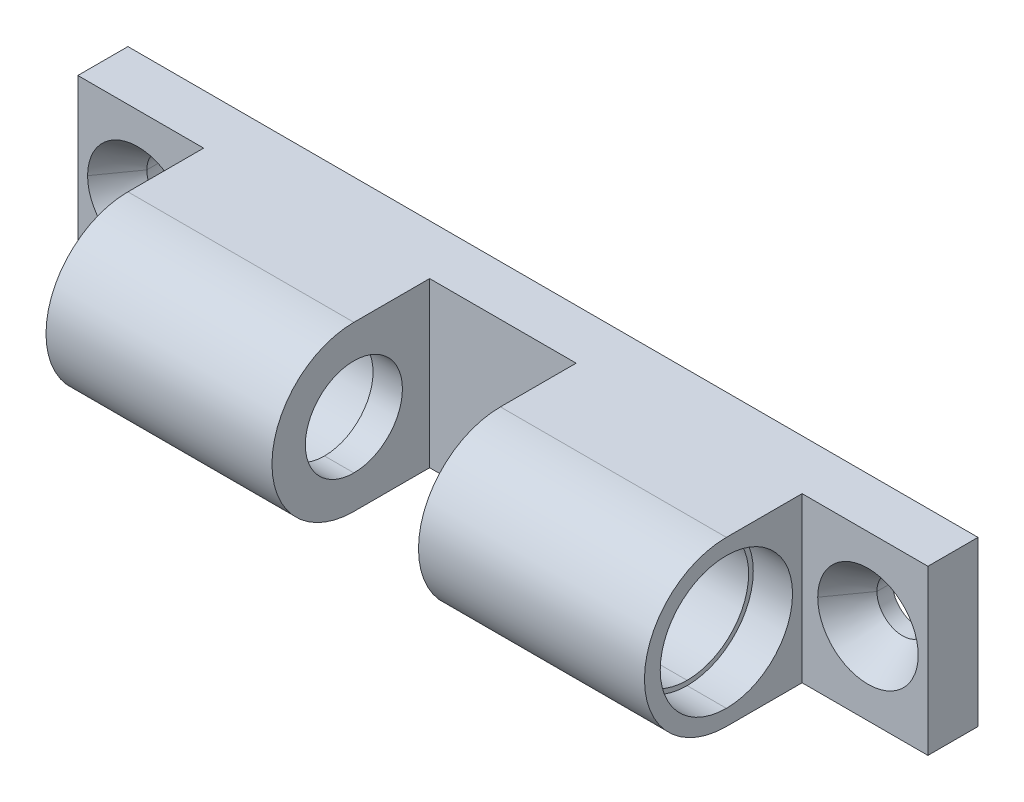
ISO-10303-21;
HEADER;
FILE_DESCRIPTION(('STEP AP214'),'2;1');
FILE_NAME('part.step','',(''),(''),'','','');
FILE_SCHEMA(('AUTOMOTIVE_DESIGN { 1 0 10303 214 1 1 1 1 }'));
ENDSEC;
DATA;
#1=APPLICATION_CONTEXT('core data for automotive mechanical design processes');
#2=APPLICATION_PROTOCOL_DEFINITION('international standard','automotive_design',2000,#1);
#3=PRODUCT_CONTEXT('',#1,'mechanical');
#4=PRODUCT('Part','Part','',(#3));
#5=PRODUCT_RELATED_PRODUCT_CATEGORY('part','',(#4));
#6=PRODUCT_DEFINITION_FORMATION('','',#4);
#7=PRODUCT_DEFINITION_CONTEXT('part definition',#1,'design');
#8=PRODUCT_DEFINITION('design','',#6,#7);
#9=PRODUCT_DEFINITION_SHAPE('','',#8);
#10=(LENGTH_UNIT() NAMED_UNIT(*) SI_UNIT(.MILLI.,.METRE.));
#11=(NAMED_UNIT(*) PLANE_ANGLE_UNIT() SI_UNIT($,.RADIAN.));
#12=(NAMED_UNIT(*) SI_UNIT($,.STERADIAN.) SOLID_ANGLE_UNIT());
#13=UNCERTAINTY_MEASURE_WITH_UNIT(LENGTH_MEASURE(1.E-05),#10,'distance_accuracy_value','');
#14=(GEOMETRIC_REPRESENTATION_CONTEXT(3) GLOBAL_UNCERTAINTY_ASSIGNED_CONTEXT((#13)) GLOBAL_UNIT_ASSIGNED_CONTEXT((#10,
#11,#12)) REPRESENTATION_CONTEXT('',''));
#15=CARTESIAN_POINT('',(0.,0.,0.));
#16=DIRECTION('',(0.,0.,1.));
#17=DIRECTION('',(1.,0.,0.));
#18=AXIS2_PLACEMENT_3D('',#15,#16,#17);
#19=CARTESIAN_POINT('',(-5.53720000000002,35.179,15.113));
#20=DIRECTION('',(1.,0.,0.));
#21=DIRECTION('',(0.,0.,-1.));
#22=AXIS2_PLACEMENT_3D('',#19,#20,#21);
#23=CYLINDRICAL_SURFACE('',#22,5.0546);
#24=CARTESIAN_POINT('',(-2.31140000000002,35.179,15.113));
#25=DIRECTION('',(1.,0.,0.));
#26=DIRECTION('',(0.,0.,-1.));
#27=AXIS2_PLACEMENT_3D('',#24,#25,#26);
#28=CIRCLE('',#27,5.0546);
#29=CARTESIAN_POINT('',(-2.31140000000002,40.2336,15.113));
#30=VERTEX_POINT('',#29);
#31=CARTESIAN_POINT('',(-2.31140000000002,30.1244,15.113));
#32=VERTEX_POINT('',#31);
#33=EDGE_CURVE('E225',#30,#32,#28,.T.);
#34=ORIENTED_EDGE('',*,*,#33,.F.);
#35=DIRECTION('',(1.,0.,0.));
#36=VECTOR('',#35,1.);
#37=CARTESIAN_POINT('',(-5.53720000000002,40.2336,15.113));
#38=LINE('',#37,#36);
#39=CARTESIAN_POINT('',(10.6172,40.2336,15.113));
#40=VERTEX_POINT('',#39);
#41=EDGE_CURVE('E326',#30,#40,#38,.T.);
#42=ORIENTED_EDGE('',*,*,#41,.T.);
#43=CARTESIAN_POINT('',(10.6172,35.179,15.113));
#44=DIRECTION('',(1.,0.,0.));
#45=DIRECTION('',(0.,0.,-1.));
#46=AXIS2_PLACEMENT_3D('',#43,#44,#45);
#47=CIRCLE('',#46,5.0546);
#48=CARTESIAN_POINT('',(10.6172,30.1244,15.113));
#49=VERTEX_POINT('',#48);
#50=EDGE_CURVE('E230',#49,#40,#47,.F.);
#51=ORIENTED_EDGE('',*,*,#50,.F.);
#52=DIRECTION('',(1.,0.,0.));
#53=VECTOR('',#52,1.);
#54=CARTESIAN_POINT('',(-5.53720000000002,30.1244,15.113));
#55=LINE('',#54,#53);
#56=EDGE_CURVE('E218',#49,#32,#55,.F.);
#57=ORIENTED_EDGE('',*,*,#56,.T.);
#58=EDGE_LOOP('',(#34,#42,#51,#57));
#59=FACE_BOUND('',#58,.T.);
#60=ADVANCED_FACE('F17',(#59),#23,.F.);
#61=CARTESIAN_POINT('',(-5.53720000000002,35.179,15.113));
#62=DIRECTION('',(1.,0.,0.));
#63=DIRECTION('',(0.,0.,-1.));
#64=AXIS2_PLACEMENT_3D('',#61,#62,#63);
#65=CYLINDRICAL_SURFACE('',#64,5.0546);
#66=CARTESIAN_POINT('',(10.6172,35.179,15.113));
#67=DIRECTION('',(1.,0.,0.));
#68=DIRECTION('',(0.,0.,-1.));
#69=AXIS2_PLACEMENT_3D('',#66,#67,#68);
#70=CIRCLE('',#69,5.0546);
#71=EDGE_CURVE('E233',#40,#49,#70,.F.);
#72=ORIENTED_EDGE('',*,*,#71,.F.);
#73=ORIENTED_EDGE('',*,*,#41,.F.);
#74=CARTESIAN_POINT('',(-2.31140000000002,35.179,15.113));
#75=DIRECTION('',(1.,0.,0.));
#76=DIRECTION('',(0.,0.,-1.));
#77=AXIS2_PLACEMENT_3D('',#74,#75,#76);
#78=CIRCLE('',#77,5.0546);
#79=EDGE_CURVE('E223',#32,#30,#78,.T.);
#80=ORIENTED_EDGE('',*,*,#79,.F.);
#81=ORIENTED_EDGE('',*,*,#56,.F.);
#82=EDGE_LOOP('',(#72,#73,#80,#81));
#83=FACE_BOUND('',#82,.T.);
#84=ADVANCED_FACE('F887',(#83),#65,.F.);
#85=CARTESIAN_POINT('',(43.6372,35.179,15.113));
#86=DIRECTION('',(1.,0.,0.));
#87=DIRECTION('',(0.,1.,0.));
#88=AXIS2_PLACEMENT_3D('',#85,#86,#87);
#89=CYLINDRICAL_SURFACE('',#88,5.0546);
#90=CARTESIAN_POINT('',(27.4828,35.1790000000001,15.113));
#91=DIRECTION('',(1.,0.,0.));
#92=DIRECTION('',(0.,1.,0.));
#93=AXIS2_PLACEMENT_3D('',#90,#91,#92);
#94=CIRCLE('',#93,5.0546);
#95=CARTESIAN_POINT('',(27.4828,40.2336000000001,15.113));
#96=VERTEX_POINT('',#95);
#97=CARTESIAN_POINT('',(27.4828,30.1244000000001,15.113));
#98=VERTEX_POINT('',#97);
#99=EDGE_CURVE('E216',#96,#98,#94,.T.);
#100=ORIENTED_EDGE('',*,*,#99,.F.);
#101=DIRECTION('',(1.,0.,0.));
#102=VECTOR('',#101,1.);
#103=CARTESIAN_POINT('',(43.6372,40.2336,15.113));
#104=LINE('',#103,#102);
#105=CARTESIAN_POINT('',(40.4113999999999,40.2336000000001,15.113));
#106=VERTEX_POINT('',#105);
#107=EDGE_CURVE('E210',#96,#106,#104,.T.);
#108=ORIENTED_EDGE('',*,*,#107,.T.);
#109=CARTESIAN_POINT('',(40.4113999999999,35.1790000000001,15.113));
#110=DIRECTION('',(1.,0.,0.));
#111=DIRECTION('',(0.,1.,0.));
#112=AXIS2_PLACEMENT_3D('',#109,#110,#111);
#113=CIRCLE('',#112,5.0546);
#114=CARTESIAN_POINT('',(40.4113999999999,30.1244,15.113));
#115=VERTEX_POINT('',#114);
#116=EDGE_CURVE('E213',#106,#115,#113,.T.);
#117=ORIENTED_EDGE('',*,*,#116,.T.);
#118=DIRECTION('',(1.,0.,0.));
#119=VECTOR('',#118,1.);
#120=CARTESIAN_POINT('',(43.6372,30.1244,15.113));
#121=LINE('',#120,#119);
#122=EDGE_CURVE('E205',#115,#98,#121,.F.);
#123=ORIENTED_EDGE('',*,*,#122,.T.);
#124=EDGE_LOOP('',(#100,#108,#117,#123));
#125=FACE_BOUND('',#124,.T.);
#126=ADVANCED_FACE('F211',(#125),#89,.F.);
#127=CARTESIAN_POINT('',(43.6372,35.179,15.113));
#128=DIRECTION('',(1.,0.,0.));
#129=DIRECTION('',(0.,1.,0.));
#130=AXIS2_PLACEMENT_3D('',#127,#128,#129);
#131=CYLINDRICAL_SURFACE('',#130,5.0546);
#132=CARTESIAN_POINT('',(40.4113999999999,35.1790000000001,15.113));
#133=DIRECTION('',(1.,0.,0.));
#134=DIRECTION('',(0.,1.,0.));
#135=AXIS2_PLACEMENT_3D('',#132,#133,#134);
#136=CIRCLE('',#135,5.0546);
#137=EDGE_CURVE('E20',#115,#106,#136,.T.);
#138=ORIENTED_EDGE('',*,*,#137,.T.);
#139=ORIENTED_EDGE('',*,*,#107,.F.);
#140=CARTESIAN_POINT('',(27.4828,35.1790000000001,15.113));
#141=DIRECTION('',(1.,0.,0.));
#142=DIRECTION('',(0.,1.,0.));
#143=AXIS2_PLACEMENT_3D('',#140,#141,#142);
#144=CIRCLE('',#143,5.0546);
#145=EDGE_CURVE('E237',#98,#96,#144,.T.);
#146=ORIENTED_EDGE('',*,*,#145,.F.);
#147=ORIENTED_EDGE('',*,*,#122,.F.);
#148=EDGE_LOOP('',(#138,#139,#146,#147));
#149=FACE_BOUND('',#148,.T.);
#150=ADVANCED_FACE('F220',(#149),#131,.F.);
#151=CARTESIAN_POINT('',(40.4113999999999,35.1789999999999,15.1130000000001));
#152=DIRECTION('',(-1.,0.,0.));
#153=DIRECTION('',(0.,0.,1.));
#154=AXIS2_PLACEMENT_3D('',#151,#152,#153);
#155=PLANE('',#154);
#156=CARTESIAN_POINT('',(40.4113999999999,35.1789999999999,15.1130000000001));
#157=DIRECTION('',(1.,0.,0.));
#158=DIRECTION('',(0.,0.,-1.));
#159=AXIS2_PLACEMENT_3D('',#156,#157,#158);
#160=CIRCLE('',#159,5.4356);
#161=CARTESIAN_POINT('',(40.4113999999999,29.7433999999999,15.1130000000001));
#162=VERTEX_POINT('',#161);
#163=CARTESIAN_POINT('',(40.4113999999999,40.6145999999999,15.1130000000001));
#164=VERTEX_POINT('',#163);
#165=EDGE_CURVE('E239',#162,#164,#160,.T.);
#166=ORIENTED_EDGE('',*,*,#165,.T.);
#167=CARTESIAN_POINT('',(40.4113999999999,35.1789999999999,15.1130000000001));
#168=DIRECTION('',(1.,0.,0.));
#169=DIRECTION('',(0.,0.,-1.));
#170=AXIS2_PLACEMENT_3D('',#167,#168,#169);
#171=CIRCLE('',#170,5.4356);
#172=EDGE_CURVE('E242',#164,#162,#171,.T.);
#173=ORIENTED_EDGE('',*,*,#172,.T.);
#174=EDGE_LOOP('',(#166,#173));
#175=FACE_BOUND('',#174,.T.);
#176=ORIENTED_EDGE('',*,*,#137,.F.);
#177=ORIENTED_EDGE('',*,*,#116,.F.);
#178=EDGE_LOOP('',(#176,#177));
#179=FACE_BOUND('',#178,.T.);
#180=ADVANCED_FACE('F222',(#175,#179),#155,.F.);
#181=CARTESIAN_POINT('',(-2.31140000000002,29.7434000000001,15.113));
#182=DIRECTION('',(-1.,0.,0.));
#183=DIRECTION('',(0.,0.,1.));
#184=AXIS2_PLACEMENT_3D('',#181,#182,#183);
#185=PLANE('',#184);
#186=CARTESIAN_POINT('',(-2.31140000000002,35.179,15.113));
#187=DIRECTION('',(1.,0.,0.));
#188=DIRECTION('',(0.,0.,-1.));
#189=AXIS2_PLACEMENT_3D('',#186,#187,#188);
#190=CIRCLE('',#189,5.4356);
#191=CARTESIAN_POINT('',(-2.31140000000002,29.7434,15.113));
#192=VERTEX_POINT('',#191);
#193=CARTESIAN_POINT('',(-2.31140000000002,40.6146,15.113));
#194=VERTEX_POINT('',#193);
#195=EDGE_CURVE('E247',#192,#194,#190,.F.);
#196=ORIENTED_EDGE('',*,*,#195,.T.);
#197=CARTESIAN_POINT('',(-2.31140000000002,35.179,15.113));
#198=DIRECTION('',(1.,0.,0.));
#199=DIRECTION('',(0.,0.,-1.));
#200=AXIS2_PLACEMENT_3D('',#197,#198,#199);
#201=CIRCLE('',#200,5.4356);
#202=EDGE_CURVE('E245',#194,#192,#201,.F.);
#203=ORIENTED_EDGE('',*,*,#202,.T.);
#204=EDGE_LOOP('',(#196,#203));
#205=FACE_BOUND('',#204,.T.);
#206=ORIENTED_EDGE('',*,*,#79,.T.);
#207=ORIENTED_EDGE('',*,*,#33,.T.);
#208=EDGE_LOOP('',(#206,#207));
#209=FACE_BOUND('',#208,.T.);
#210=ADVANCED_FACE('F851',(#205,#209),#185,.T.);
#211=CARTESIAN_POINT('',(10.6172,30.1244000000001,15.113));
#212=DIRECTION('',(-1.,0.,0.));
#213=DIRECTION('',(0.,0.,1.));
#214=AXIS2_PLACEMENT_3D('',#211,#212,#213);
#215=PLANE('',#214);
#216=CARTESIAN_POINT('',(10.6172,35.179,15.113));
#217=DIRECTION('',(1.,0.,0.));
#218=DIRECTION('',(0.,0.,-1.));
#219=AXIS2_PLACEMENT_3D('',#216,#217,#218);
#220=CIRCLE('',#219,3.9878);
#221=CARTESIAN_POINT('',(10.6172,39.1668,15.113));
#222=VERTEX_POINT('',#221);
#223=CARTESIAN_POINT('',(10.6172,31.1912,15.113));
#224=VERTEX_POINT('',#223);
#225=EDGE_CURVE('E254',#222,#224,#220,.T.);
#226=ORIENTED_EDGE('',*,*,#225,.T.);
#227=CARTESIAN_POINT('',(10.6172,35.179,15.113));
#228=DIRECTION('',(1.,0.,0.));
#229=DIRECTION('',(0.,0.,-1.));
#230=AXIS2_PLACEMENT_3D('',#227,#228,#229);
#231=CIRCLE('',#230,3.9878);
#232=EDGE_CURVE('E250',#224,#222,#231,.T.);
#233=ORIENTED_EDGE('',*,*,#232,.T.);
#234=EDGE_LOOP('',(#226,#233));
#235=FACE_BOUND('',#234,.T.);
#236=ORIENTED_EDGE('',*,*,#50,.T.);
#237=ORIENTED_EDGE('',*,*,#71,.T.);
#238=EDGE_LOOP('',(#236,#237));
#239=FACE_BOUND('',#238,.T.);
#240=ADVANCED_FACE('F841',(#235,#239),#215,.T.);
#241=CARTESIAN_POINT('',(27.4828,30.1244000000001,15.113));
#242=DIRECTION('',(1.,0.,0.));
#243=DIRECTION('',(0.,1.,0.));
#244=AXIS2_PLACEMENT_3D('',#241,#242,#243);
#245=PLANE('',#244);
#246=CARTESIAN_POINT('',(27.4828,35.179,15.113));
#247=DIRECTION('',(1.,0.,0.));
#248=DIRECTION('',(0.,1.,0.));
#249=AXIS2_PLACEMENT_3D('',#246,#247,#248);
#250=CIRCLE('',#249,3.9878);
#251=CARTESIAN_POINT('',(27.4828,31.1912,15.113));
#252=VERTEX_POINT('',#251);
#253=CARTESIAN_POINT('',(27.4828,39.1668,15.113));
#254=VERTEX_POINT('',#253);
#255=EDGE_CURVE('E259',#252,#254,#250,.F.);
#256=ORIENTED_EDGE('',*,*,#255,.T.);
#257=CARTESIAN_POINT('',(27.4828,35.179,15.113));
#258=DIRECTION('',(1.,0.,0.));
#259=DIRECTION('',(0.,1.,0.));
#260=AXIS2_PLACEMENT_3D('',#257,#258,#259);
#261=CIRCLE('',#260,3.9878);
#262=EDGE_CURVE('E257',#254,#252,#261,.F.);
#263=ORIENTED_EDGE('',*,*,#262,.T.);
#264=EDGE_LOOP('',(#256,#263));
#265=FACE_BOUND('',#264,.T.);
#266=ORIENTED_EDGE('',*,*,#99,.T.);
#267=ORIENTED_EDGE('',*,*,#145,.T.);
#268=EDGE_LOOP('',(#266,#267));
#269=FACE_BOUND('',#268,.T.);
#270=ADVANCED_FACE('F831',(#265,#269),#245,.T.);
#271=CARTESIAN_POINT('',(40.4113999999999,35.1789999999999,15.1130000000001));
#272=DIRECTION('',(1.,0.,0.));
#273=DIRECTION('',(0.,0.,-1.));
#274=AXIS2_PLACEMENT_3D('',#271,#272,#273);
#275=CYLINDRICAL_SURFACE('',#274,5.4356);
#276=CARTESIAN_POINT('',(43.6372,35.1789999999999,15.1130000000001));
#277=DIRECTION('',(1.,0.,0.));
#278=DIRECTION('',(0.,0.,-1.));
#279=AXIS2_PLACEMENT_3D('',#276,#277,#278);
#280=CIRCLE('',#279,5.4356);
#281=CARTESIAN_POINT('',(43.6371999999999,29.7433999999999,15.1130000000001));
#282=VERTEX_POINT('',#281);
#283=CARTESIAN_POINT('',(43.6371999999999,40.6145999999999,15.1130000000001));
#284=VERTEX_POINT('',#283);
#285=EDGE_CURVE('E262',#282,#284,#280,.T.);
#286=ORIENTED_EDGE('',*,*,#285,.T.);
#287=DIRECTION('',(1.,0.,0.));
#288=VECTOR('',#287,1.);
#289=CARTESIAN_POINT('',(40.4113999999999,40.6145999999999,15.1130000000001));
#290=LINE('',#289,#288);
#291=EDGE_CURVE('E241',#284,#164,#290,.F.);
#292=ORIENTED_EDGE('',*,*,#291,.T.);
#293=ORIENTED_EDGE('',*,*,#165,.F.);
#294=DIRECTION('',(1.,0.,0.));
#295=VECTOR('',#294,1.);
#296=CARTESIAN_POINT('',(40.4113999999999,29.7433999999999,15.1130000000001));
#297=LINE('',#296,#295);
#298=EDGE_CURVE('E244',#162,#282,#297,.T.);
#299=ORIENTED_EDGE('',*,*,#298,.T.);
#300=EDGE_LOOP('',(#286,#292,#293,#299));
#301=FACE_BOUND('',#300,.T.);
#302=ADVANCED_FACE('F821',(#301),#275,.F.);
#303=CARTESIAN_POINT('',(40.4113999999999,35.1789999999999,15.1130000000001));
#304=DIRECTION('',(1.,0.,0.));
#305=DIRECTION('',(0.,0.,-1.));
#306=AXIS2_PLACEMENT_3D('',#303,#304,#305);
#307=CYLINDRICAL_SURFACE('',#306,5.4356);
#308=ORIENTED_EDGE('',*,*,#172,.F.);
#309=ORIENTED_EDGE('',*,*,#291,.F.);
#310=CARTESIAN_POINT('',(43.6371999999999,35.1789999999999,15.1130000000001));
#311=DIRECTION('',(1.,0.,0.));
#312=DIRECTION('',(0.,0.,-1.));
#313=AXIS2_PLACEMENT_3D('',#310,#311,#312);
#314=CIRCLE('',#313,5.4356);
#315=EDGE_CURVE('E264',#284,#282,#314,.T.);
#316=ORIENTED_EDGE('',*,*,#315,.T.);
#317=ORIENTED_EDGE('',*,*,#298,.F.);
#318=EDGE_LOOP('',(#308,#309,#316,#317));
#319=FACE_BOUND('',#318,.T.);
#320=ADVANCED_FACE('F811',(#319),#307,.F.);
#321=CARTESIAN_POINT('',(-5.53720000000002,35.179,15.113));
#322=DIRECTION('',(1.,0.,0.));
#323=DIRECTION('',(0.,0.,-1.));
#324=AXIS2_PLACEMENT_3D('',#321,#322,#323);
#325=CYLINDRICAL_SURFACE('',#324,5.4356);
#326=ORIENTED_EDGE('',*,*,#202,.F.);
#327=DIRECTION('',(1.,0.,0.));
#328=VECTOR('',#327,1.);
#329=CARTESIAN_POINT('',(-5.53720000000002,40.6146,15.113));
#330=LINE('',#329,#328);
#331=CARTESIAN_POINT('',(-5.53720000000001,40.6146,15.113));
#332=VERTEX_POINT('',#331);
#333=EDGE_CURVE('E249',#194,#332,#330,.F.);
#334=ORIENTED_EDGE('',*,*,#333,.T.);
#335=CARTESIAN_POINT('',(-5.53720000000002,35.179,15.113));
#336=DIRECTION('',(1.,0.,0.));
#337=DIRECTION('',(0.,0.,-1.));
#338=AXIS2_PLACEMENT_3D('',#335,#336,#337);
#339=CIRCLE('',#338,5.4356);
#340=CARTESIAN_POINT('',(-5.53720000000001,29.7434,15.113));
#341=VERTEX_POINT('',#340);
#342=EDGE_CURVE('E281',#341,#332,#339,.T.);
#343=ORIENTED_EDGE('',*,*,#342,.F.);
#344=DIRECTION('',(1.,0.,0.));
#345=VECTOR('',#344,1.);
#346=CARTESIAN_POINT('',(-5.53720000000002,29.7434,15.113));
#347=LINE('',#346,#345);
#348=EDGE_CURVE('E253',#341,#192,#347,.T.);
#349=ORIENTED_EDGE('',*,*,#348,.T.);
#350=EDGE_LOOP('',(#326,#334,#343,#349));
#351=FACE_BOUND('',#350,.T.);
#352=ADVANCED_FACE('F801',(#351),#325,.F.);
#353=CARTESIAN_POINT('',(-5.53720000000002,35.179,15.113));
#354=DIRECTION('',(1.,0.,0.));
#355=DIRECTION('',(0.,0.,-1.));
#356=AXIS2_PLACEMENT_3D('',#353,#354,#355);
#357=CYLINDRICAL_SURFACE('',#356,5.4356);
#358=CARTESIAN_POINT('',(-5.53719999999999,35.179,15.113));
#359=DIRECTION('',(1.,0.,0.));
#360=DIRECTION('',(0.,0.,-1.));
#361=AXIS2_PLACEMENT_3D('',#358,#359,#360);
#362=CIRCLE('',#361,5.4356);
#363=EDGE_CURVE('E284',#332,#341,#362,.T.);
#364=ORIENTED_EDGE('',*,*,#363,.F.);
#365=ORIENTED_EDGE('',*,*,#333,.F.);
#366=ORIENTED_EDGE('',*,*,#195,.F.);
#367=ORIENTED_EDGE('',*,*,#348,.F.);
#368=EDGE_LOOP('',(#364,#365,#366,#367));
#369=FACE_BOUND('',#368,.T.);
#370=ADVANCED_FACE('F791',(#369),#357,.F.);
#371=CARTESIAN_POINT('',(10.6172,35.179,15.113));
#372=DIRECTION('',(1.,0.,0.));
#373=DIRECTION('',(0.,0.,-1.));
#374=AXIS2_PLACEMENT_3D('',#371,#372,#373);
#375=CYLINDRICAL_SURFACE('',#374,3.9878);
#376=CARTESIAN_POINT('',(13.0302,35.179,15.113));
#377=DIRECTION('',(1.,0.,0.));
#378=DIRECTION('',(0.,0.,-1.));
#379=AXIS2_PLACEMENT_3D('',#376,#377,#378);
#380=CIRCLE('',#379,3.9878);
#381=CARTESIAN_POINT('',(13.0302,31.1912,15.113));
#382=VERTEX_POINT('',#381);
#383=CARTESIAN_POINT('',(13.0302,39.1668,15.113));
#384=VERTEX_POINT('',#383);
#385=EDGE_CURVE('E290',#382,#384,#380,.T.);
#386=ORIENTED_EDGE('',*,*,#385,.T.);
#387=DIRECTION('',(1.,0.,0.));
#388=VECTOR('',#387,1.);
#389=CARTESIAN_POINT('',(10.6172,39.1668,15.113));
#390=LINE('',#389,#388);
#391=EDGE_CURVE('E252',#384,#222,#390,.F.);
#392=ORIENTED_EDGE('',*,*,#391,.T.);
#393=ORIENTED_EDGE('',*,*,#232,.F.);
#394=DIRECTION('',(1.,0.,0.));
#395=VECTOR('',#394,1.);
#396=CARTESIAN_POINT('',(10.6172,31.1912,15.113));
#397=LINE('',#396,#395);
#398=EDGE_CURVE('E256',#224,#382,#397,.T.);
#399=ORIENTED_EDGE('',*,*,#398,.T.);
#400=EDGE_LOOP('',(#386,#392,#393,#399));
#401=FACE_BOUND('',#400,.T.);
#402=ADVANCED_FACE('F781',(#401),#375,.F.);
#403=CARTESIAN_POINT('',(10.6172,35.179,15.113));
#404=DIRECTION('',(1.,0.,0.));
#405=DIRECTION('',(0.,0.,-1.));
#406=AXIS2_PLACEMENT_3D('',#403,#404,#405);
#407=CYLINDRICAL_SURFACE('',#406,3.9878);
#408=ORIENTED_EDGE('',*,*,#225,.F.);
#409=ORIENTED_EDGE('',*,*,#391,.F.);
#410=CARTESIAN_POINT('',(13.0302,35.179,15.113));
#411=DIRECTION('',(1.,0.,0.));
#412=DIRECTION('',(0.,0.,-1.));
#413=AXIS2_PLACEMENT_3D('',#410,#411,#412);
#414=CIRCLE('',#413,3.9878);
#415=EDGE_CURVE('E292',#384,#382,#414,.T.);
#416=ORIENTED_EDGE('',*,*,#415,.T.);
#417=ORIENTED_EDGE('',*,*,#398,.F.);
#418=EDGE_LOOP('',(#408,#409,#416,#417));
#419=FACE_BOUND('',#418,.T.);
#420=ADVANCED_FACE('F771',(#419),#407,.F.);
#421=CARTESIAN_POINT('',(27.4828,35.179,15.113));
#422=DIRECTION('',(1.,0.,0.));
#423=DIRECTION('',(0.,1.,0.));
#424=AXIS2_PLACEMENT_3D('',#421,#422,#423);
#425=CYLINDRICAL_SURFACE('',#424,3.9878);
#426=ORIENTED_EDGE('',*,*,#262,.F.);
#427=DIRECTION('',(1.,0.,0.));
#428=VECTOR('',#427,1.);
#429=CARTESIAN_POINT('',(27.4828,39.1668,15.113));
#430=LINE('',#429,#428);
#431=CARTESIAN_POINT('',(25.0698,39.1668,15.113));
#432=VERTEX_POINT('',#431);
#433=EDGE_CURVE('E261',#254,#432,#430,.F.);
#434=ORIENTED_EDGE('',*,*,#433,.T.);
#435=CARTESIAN_POINT('',(25.0698,35.179,15.113));
#436=DIRECTION('',(1.,0.,0.));
#437=DIRECTION('',(0.,1.,0.));
#438=AXIS2_PLACEMENT_3D('',#435,#436,#437);
#439=CIRCLE('',#438,3.9878);
#440=CARTESIAN_POINT('',(25.0698,31.1912,15.113));
#441=VERTEX_POINT('',#440);
#442=EDGE_CURVE('E298',#441,#432,#439,.T.);
#443=ORIENTED_EDGE('',*,*,#442,.F.);
#444=DIRECTION('',(1.,0.,0.));
#445=VECTOR('',#444,1.);
#446=CARTESIAN_POINT('',(27.4828,31.1912,15.113));
#447=LINE('',#446,#445);
#448=EDGE_CURVE('E338',#441,#252,#447,.T.);
#449=ORIENTED_EDGE('',*,*,#448,.T.);
#450=EDGE_LOOP('',(#426,#434,#443,#449));
#451=FACE_BOUND('',#450,.T.);
#452=ADVANCED_FACE('F761',(#451),#425,.F.);
#453=CARTESIAN_POINT('',(27.4828,35.179,15.113));
#454=DIRECTION('',(1.,0.,0.));
#455=DIRECTION('',(0.,1.,0.));
#456=AXIS2_PLACEMENT_3D('',#453,#454,#455);
#457=CYLINDRICAL_SURFACE('',#456,3.9878);
#458=CARTESIAN_POINT('',(25.0697999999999,35.179,15.113));
#459=DIRECTION('',(1.,0.,0.));
#460=DIRECTION('',(0.,1.,0.));
#461=AXIS2_PLACEMENT_3D('',#458,#459,#460);
#462=CIRCLE('',#461,3.9878);
#463=EDGE_CURVE('E301',#432,#441,#462,.T.);
#464=ORIENTED_EDGE('',*,*,#463,.F.);
#465=ORIENTED_EDGE('',*,*,#433,.F.);
#466=ORIENTED_EDGE('',*,*,#255,.F.);
#467=ORIENTED_EDGE('',*,*,#448,.F.);
#468=EDGE_LOOP('',(#464,#465,#466,#467));
#469=FACE_BOUND('',#468,.T.);
#470=ADVANCED_FACE('F751',(#469),#457,.F.);
#471=CARTESIAN_POINT('',(49.0474,35.1789999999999,8.88999999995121));
#472=DIRECTION('',(0.,0.,1.));
#473=DIRECTION('',(1.,0.,0.));
#474=AXIS2_PLACEMENT_3D('',#471,#472,#473);
#475=CONICAL_SURFACE('',#474,4.12749999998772,0.617286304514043);
#476=CARTESIAN_POINT('',(49.0474,35.1789999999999,8.88999999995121));
#477=DIRECTION('',(0.,0.,1.));
#478=DIRECTION('',(1.,0.,0.));
#479=AXIS2_PLACEMENT_3D('',#476,#477,#478);
#480=CIRCLE('',#479,4.12749999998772);
#481=CARTESIAN_POINT('',(44.9199000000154,35.179,8.88999999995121));
#482=VERTEX_POINT('',#481);
#483=CARTESIAN_POINT('',(53.1748999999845,35.1789999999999,8.88999999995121));
#484=VERTEX_POINT('',#483);
#485=EDGE_CURVE('E272',#482,#484,#480,.F.);
#486=ORIENTED_EDGE('',*,*,#485,.F.);
#487=DIRECTION('',(0.578824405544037,0.,-0.815452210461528));
#488=VECTOR('',#487,1.);
#489=CARTESIAN_POINT('',(-354149.021709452,35.1790000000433,499000.));
#490=LINE('',#489,#488);
#491=CARTESIAN_POINT('',(46.9391990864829,35.1789999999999,6.04520000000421));
#492=VERTEX_POINT('',#491);
#493=EDGE_CURVE('E341',#482,#492,#490,.T.);
#494=ORIENTED_EDGE('',*,*,#493,.T.);
#495=CARTESIAN_POINT('',(49.0474,35.1789999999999,6.0452));
#496=DIRECTION('',(0.,0.,1.));
#497=DIRECTION('',(1.,0.,0.));
#498=AXIS2_PLACEMENT_3D('',#495,#496,#497);
#499=CIRCLE('',#498,2.1082);
#500=CARTESIAN_POINT('',(51.1556009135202,35.1789999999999,6.04520000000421));
#501=VERTEX_POINT('',#500);
#502=EDGE_CURVE('E310',#492,#501,#499,.F.);
#503=ORIENTED_EDGE('',*,*,#502,.T.);
#504=DIRECTION('',(-0.578824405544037,0.,-0.815452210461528));
#505=VECTOR('',#504,1.);
#506=CARTESIAN_POINT('',(354247.116509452,35.1789999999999,499000.));
#507=LINE('',#506,#505);
#508=EDGE_CURVE('E346',#501,#484,#507,.F.);
#509=ORIENTED_EDGE('',*,*,#508,.T.);
#510=EDGE_LOOP('',(#486,#494,#503,#509));
#511=FACE_BOUND('',#510,.T.);
#512=ADVANCED_FACE('F741',(#511),#475,.F.);
#513=CARTESIAN_POINT('',(49.0474,35.1789999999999,8.88999999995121));
#514=DIRECTION('',(0.,0.,1.));
#515=DIRECTION('',(1.,0.,0.));
#516=AXIS2_PLACEMENT_3D('',#513,#514,#515);
#517=CONICAL_SURFACE('',#516,4.12749999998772,0.617286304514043);
#518=CARTESIAN_POINT('',(49.0474,35.1789999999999,6.0452));
#519=DIRECTION('',(0.,0.,1.));
#520=DIRECTION('',(1.,0.,0.));
#521=AXIS2_PLACEMENT_3D('',#518,#519,#520);
#522=CIRCLE('',#521,2.1082);
#523=EDGE_CURVE('E353',#501,#492,#522,.F.);
#524=ORIENTED_EDGE('',*,*,#523,.T.);
#525=ORIENTED_EDGE('',*,*,#493,.F.);
#526=CARTESIAN_POINT('',(49.0474,35.1789999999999,8.88999999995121));
#527=DIRECTION('',(0.,0.,1.));
#528=DIRECTION('',(1.,0.,0.));
#529=AXIS2_PLACEMENT_3D('',#526,#527,#528);
#530=CIRCLE('',#529,4.12749999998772);
#531=EDGE_CURVE('E269',#484,#482,#530,.F.);
#532=ORIENTED_EDGE('',*,*,#531,.F.);
#533=ORIENTED_EDGE('',*,*,#508,.F.);
#534=EDGE_LOOP('',(#524,#525,#532,#533));
#535=FACE_BOUND('',#534,.T.);
#536=ADVANCED_FACE('F731',(#535),#517,.F.);
#537=CARTESIAN_POINT('',(-10.9474,35.1789999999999,8.88999999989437));
#538=DIRECTION('',(0.,0.,1.));
#539=DIRECTION('',(1.,0.,0.));
#540=AXIS2_PLACEMENT_3D('',#537,#538,#539);
#541=CONICAL_SURFACE('',#540,4.12749999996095,0.617286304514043);
#542=CARTESIAN_POINT('',(-10.9474,35.1789999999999,8.89000000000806));
#543=DIRECTION('',(0.,0.,1.));
#544=DIRECTION('',(1.,0.,0.));
#545=AXIS2_PLACEMENT_3D('',#542,#543,#544);
#546=CIRCLE('',#545,4.12750000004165);
#547=CARTESIAN_POINT('',(-15.0749000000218,35.1789999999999,8.89000000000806));
#548=VERTEX_POINT('',#547);
#549=CARTESIAN_POINT('',(-6.8198999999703,35.1789999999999,8.89000000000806));
#550=VERTEX_POINT('',#549);
#551=EDGE_CURVE('E278',#548,#550,#546,.F.);
#552=ORIENTED_EDGE('',*,*,#551,.F.);
#553=DIRECTION('',(0.578824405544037,0.,-0.815452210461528));
#554=VECTOR('',#553,1.);
#555=CARTESIAN_POINT('',(-354209.016509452,35.1790000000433,499000.));
#556=LINE('',#555,#554);
#557=CARTESIAN_POINT('',(-13.0556009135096,35.1789999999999,6.04519999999));
#558=VERTEX_POINT('',#557);
#559=EDGE_CURVE('E350',#548,#558,#556,.T.);
#560=ORIENTED_EDGE('',*,*,#559,.T.);
#561=CARTESIAN_POINT('',(-10.9474,35.1789999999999,6.0452));
#562=DIRECTION('',(0.,0.,1.));
#563=DIRECTION('',(1.,0.,0.));
#564=AXIS2_PLACEMENT_3D('',#561,#562,#563);
#565=CIRCLE('',#564,2.1082);
#566=CARTESIAN_POINT('',(-8.83919908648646,35.1789999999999,6.04519999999));
#567=VERTEX_POINT('',#566);
#568=EDGE_CURVE('E372',#558,#567,#565,.F.);
#569=ORIENTED_EDGE('',*,*,#568,.T.);
#570=DIRECTION('',(-0.578824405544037,0.,-0.815452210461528));
#571=VECTOR('',#570,1.);
#572=CARTESIAN_POINT('',(354187.121709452,35.1789999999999,499000.));
#573=LINE('',#572,#571);
#574=EDGE_CURVE('E265',#567,#550,#573,.F.);
#575=ORIENTED_EDGE('',*,*,#574,.T.);
#576=EDGE_LOOP('',(#552,#560,#569,#575));
#577=FACE_BOUND('',#576,.T.);
#578=ADVANCED_FACE('F721',(#577),#541,.F.);
#579=CARTESIAN_POINT('',(-10.9474,35.1789999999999,8.88999999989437));
#580=DIRECTION('',(0.,0.,1.));
#581=DIRECTION('',(1.,0.,0.));
#582=AXIS2_PLACEMENT_3D('',#579,#580,#581);
#583=CONICAL_SURFACE('',#582,4.12749999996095,0.617286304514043);
#584=CARTESIAN_POINT('',(-10.9474,35.1789999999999,6.0452));
#585=DIRECTION('',(0.,0.,1.));
#586=DIRECTION('',(1.,0.,0.));
#587=AXIS2_PLACEMENT_3D('',#584,#585,#586);
#588=CIRCLE('',#587,2.1082);
#589=EDGE_CURVE('E368',#567,#558,#588,.F.);
#590=ORIENTED_EDGE('',*,*,#589,.T.);
#591=ORIENTED_EDGE('',*,*,#559,.F.);
#592=CARTESIAN_POINT('',(-10.9474,35.1789999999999,8.89000000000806));
#593=DIRECTION('',(0.,0.,1.));
#594=DIRECTION('',(1.,0.,0.));
#595=AXIS2_PLACEMENT_3D('',#592,#593,#594);
#596=CIRCLE('',#595,4.12750000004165);
#597=EDGE_CURVE('E275',#550,#548,#596,.F.);
#598=ORIENTED_EDGE('',*,*,#597,.F.);
#599=ORIENTED_EDGE('',*,*,#574,.F.);
#600=EDGE_LOOP('',(#590,#591,#598,#599));
#601=FACE_BOUND('',#600,.T.);
#602=ADVANCED_FACE('F711',(#601),#583,.F.);
#603=CARTESIAN_POINT('',(43.6371999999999,41.9099999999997,8.88999999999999));
#604=DIRECTION('',(-1.,0.,0.));
#605=DIRECTION('',(0.,-1.,0.));
#606=AXIS2_PLACEMENT_3D('',#603,#604,#605);
#607=PLANE('',#606);
#608=DIRECTION('',(0.,0.,1.));
#609=VECTOR('',#608,1.);
#610=CARTESIAN_POINT('',(43.6371999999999,41.9099999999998,15.1130000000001));
#611=LINE('',#610,#609);
#612=CARTESIAN_POINT('',(43.6371999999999,41.9099999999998,15.1130000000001));
#613=VERTEX_POINT('',#612);
#614=CARTESIAN_POINT('',(43.6371999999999,41.9099999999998,8.89));
#615=VERTEX_POINT('',#614);
#616=EDGE_CURVE('E440',#613,#615,#611,.F.);
#617=ORIENTED_EDGE('',*,*,#616,.F.);
#618=CARTESIAN_POINT('',(43.6371999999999,35.1789999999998,15.1130000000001));
#619=DIRECTION('',(1.,0.,0.));
#620=DIRECTION('',(0.,1.,0.));
#621=AXIS2_PLACEMENT_3D('',#618,#619,#620);
#622=CIRCLE('',#621,6.73099999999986);
#623=CARTESIAN_POINT('',(43.6371999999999,28.448,15.1130000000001));
#624=VERTEX_POINT('',#623);
#625=EDGE_CURVE('E305',#624,#613,#622,.F.);
#626=ORIENTED_EDGE('',*,*,#625,.F.);
#627=DIRECTION('',(0.,0.,1.));
#628=VECTOR('',#627,1.);
#629=CARTESIAN_POINT('',(43.6371999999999,28.448,8.88999999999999));
#630=LINE('',#629,#628);
#631=CARTESIAN_POINT('',(43.6371999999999,28.448,8.89));
#632=VERTEX_POINT('',#631);
#633=EDGE_CURVE('E386',#632,#624,#630,.T.);
#634=ORIENTED_EDGE('',*,*,#633,.F.);
#635=DIRECTION('',(0.,1.,0.));
#636=VECTOR('',#635,1.);
#637=CARTESIAN_POINT('',(43.6371999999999,28.4479999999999,8.89));
#638=LINE('',#637,#636);
#639=EDGE_CURVE('E268',#615,#632,#638,.F.);
#640=ORIENTED_EDGE('',*,*,#639,.F.);
#641=EDGE_LOOP('',(#617,#626,#634,#640));
#642=FACE_BOUND('',#641,.T.);
#643=ORIENTED_EDGE('',*,*,#285,.F.);
#644=ORIENTED_EDGE('',*,*,#315,.F.);
#645=EDGE_LOOP('',(#643,#644));
#646=FACE_BOUND('',#645,.T.);
#647=ADVANCED_FACE('F701',(#642,#646),#607,.F.);
#648=CARTESIAN_POINT('',(-15.875,28.4479999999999,8.89));
#649=DIRECTION('',(0.,0.,1.));
#650=DIRECTION('',(1.,0.,0.));
#651=AXIS2_PLACEMENT_3D('',#648,#649,#650);
#652=PLANE('',#651);
#653=ORIENTED_EDGE('',*,*,#531,.T.);
#654=ORIENTED_EDGE('',*,*,#485,.T.);
#655=EDGE_LOOP('',(#653,#654));
#656=FACE_BOUND('',#655,.T.);
#657=DIRECTION('',(0.,-1.,0.));
#658=VECTOR('',#657,1.);
#659=CARTESIAN_POINT('',(53.975,28.448,8.89));
#660=LINE('',#659,#658);
#661=CARTESIAN_POINT('',(53.975,28.448,8.89));
#662=VERTEX_POINT('',#661);
#663=CARTESIAN_POINT('',(53.975,41.9099999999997,8.89));
#664=VERTEX_POINT('',#663);
#665=EDGE_CURVE('E390',#662,#664,#660,.F.);
#666=ORIENTED_EDGE('',*,*,#665,.T.);
#667=DIRECTION('',(1.,0.,0.));
#668=VECTOR('',#667,1.);
#669=CARTESIAN_POINT('',(25.0697999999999,41.9099999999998,8.88999999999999));
#670=LINE('',#669,#668);
#671=EDGE_CURVE('E436',#615,#664,#670,.T.);
#672=ORIENTED_EDGE('',*,*,#671,.F.);
#673=ORIENTED_EDGE('',*,*,#639,.T.);
#674=DIRECTION('',(1.,0.,0.));
#675=VECTOR('',#674,1.);
#676=CARTESIAN_POINT('',(25.0697999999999,28.4480000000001,8.89));
#677=LINE('',#676,#675);
#678=EDGE_CURVE('E379',#662,#632,#677,.F.);
#679=ORIENTED_EDGE('',*,*,#678,.F.);
#680=EDGE_LOOP('',(#666,#672,#673,#679));
#681=FACE_BOUND('',#680,.T.);
#682=ADVANCED_FACE('F534',(#656,#681),#652,.T.);
#683=CARTESIAN_POINT('',(-15.875,28.4479999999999,8.89));
#684=DIRECTION('',(0.,0.,1.));
#685=DIRECTION('',(1.,0.,0.));
#686=AXIS2_PLACEMENT_3D('',#683,#684,#685);
#687=PLANE('',#686);
#688=ORIENTED_EDGE('',*,*,#597,.T.);
#689=ORIENTED_EDGE('',*,*,#551,.T.);
#690=EDGE_LOOP('',(#688,#689));
#691=FACE_BOUND('',#690,.T.);
#692=DIRECTION('',(0.,-1.,0.));
#693=VECTOR('',#692,1.);
#694=CARTESIAN_POINT('',(-15.875,35.179,8.89));
#695=LINE('',#694,#693);
#696=CARTESIAN_POINT('',(-15.875,28.4480000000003,8.89));
#697=VERTEX_POINT('',#696);
#698=CARTESIAN_POINT('',(-15.875,41.9099999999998,8.89));
#699=VERTEX_POINT('',#698);
#700=EDGE_CURVE('E429',#697,#699,#695,.F.);
#701=ORIENTED_EDGE('',*,*,#700,.F.);
#702=DIRECTION('',(1.,0.,0.));
#703=VECTOR('',#702,1.);
#704=CARTESIAN_POINT('',(25.0697999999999,28.4480000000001,8.88999999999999));
#705=LINE('',#704,#703);
#706=CARTESIAN_POINT('',(-5.53720000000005,28.4480000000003,8.88999999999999));
#707=VERTEX_POINT('',#706);
#708=EDGE_CURVE('E416',#707,#697,#705,.F.);
#709=ORIENTED_EDGE('',*,*,#708,.F.);
#710=DIRECTION('',(0.,-1.,0.));
#711=VECTOR('',#710,1.);
#712=CARTESIAN_POINT('',(-5.53720000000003,35.1790000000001,8.88999999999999));
#713=LINE('',#712,#711);
#714=CARTESIAN_POINT('',(-5.53719999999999,41.9099999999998,8.89));
#715=VERTEX_POINT('',#714);
#716=EDGE_CURVE('E287',#715,#707,#713,.T.);
#717=ORIENTED_EDGE('',*,*,#716,.F.);
#718=DIRECTION('',(1.,0.,0.));
#719=VECTOR('',#718,1.);
#720=CARTESIAN_POINT('',(25.0697999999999,41.9099999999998,8.89));
#721=LINE('',#720,#719);
#722=EDGE_CURVE('E457',#699,#715,#721,.T.);
#723=ORIENTED_EDGE('',*,*,#722,.F.);
#724=EDGE_LOOP('',(#701,#709,#717,#723));
#725=FACE_BOUND('',#724,.T.);
#726=ADVANCED_FACE('F682',(#691,#725),#687,.T.);
#727=CARTESIAN_POINT('',(-5.53720000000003,35.1790000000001,13.9700000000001));
#728=DIRECTION('',(-1.,0.,0.));
#729=DIRECTION('',(0.,-1.,0.));
#730=AXIS2_PLACEMENT_3D('',#727,#728,#729);
#731=PLANE('',#730);
#732=DIRECTION('',(0.,0.,1.));
#733=VECTOR('',#732,1.);
#734=CARTESIAN_POINT('',(-5.53720000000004,28.4480000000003,8.88999999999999));
#735=LINE('',#734,#733);
#736=CARTESIAN_POINT('',(-5.53720000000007,28.4480000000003,15.1130000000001));
#737=VERTEX_POINT('',#736);
#738=EDGE_CURVE('E411',#737,#707,#735,.F.);
#739=ORIENTED_EDGE('',*,*,#738,.F.);
#740=CARTESIAN_POINT('',(-5.53720000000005,35.179,15.1130000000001));
#741=DIRECTION('',(1.,0.,0.));
#742=DIRECTION('',(0.,1.,0.));
#743=AXIS2_PLACEMENT_3D('',#740,#741,#742);
#744=CIRCLE('',#743,6.73099999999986);
#745=CARTESIAN_POINT('',(-5.5372,41.9099999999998,15.1130000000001));
#746=VERTEX_POINT('',#745);
#747=EDGE_CURVE('E288',#746,#737,#744,.T.);
#748=ORIENTED_EDGE('',*,*,#747,.F.);
#749=DIRECTION('',(0.,0.,1.));
#750=VECTOR('',#749,1.);
#751=CARTESIAN_POINT('',(-5.5372,41.9099999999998,15.1130000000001));
#752=LINE('',#751,#750);
#753=EDGE_CURVE('E462',#715,#746,#752,.T.);
#754=ORIENTED_EDGE('',*,*,#753,.F.);
#755=ORIENTED_EDGE('',*,*,#716,.T.);
#756=EDGE_LOOP('',(#739,#748,#754,#755));
#757=FACE_BOUND('',#756,.T.);
#758=ORIENTED_EDGE('',*,*,#342,.T.);
#759=ORIENTED_EDGE('',*,*,#363,.T.);
#760=EDGE_LOOP('',(#758,#759));
#761=FACE_BOUND('',#760,.T.);
#762=ADVANCED_FACE('F672',(#757,#761),#731,.T.);
#763=CARTESIAN_POINT('',(-5.53720000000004,35.179,15.1130000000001));
#764=DIRECTION('',(1.,0.,0.));
#765=DIRECTION('',(0.,1.,0.));
#766=AXIS2_PLACEMENT_3D('',#763,#764,#765);
#767=CYLINDRICAL_SURFACE('',#766,6.73099999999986);
#768=ORIENTED_EDGE('',*,*,#747,.T.);
#769=DIRECTION('',(1.,0.,0.));
#770=VECTOR('',#769,1.);
#771=CARTESIAN_POINT('',(25.0697999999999,28.4480000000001,15.1130000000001));
#772=LINE('',#771,#770);
#773=CARTESIAN_POINT('',(13.0301999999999,28.4480000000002,15.1130000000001));
#774=VERTEX_POINT('',#773);
#775=EDGE_CURVE('E408',#774,#737,#772,.F.);
#776=ORIENTED_EDGE('',*,*,#775,.F.);
#777=CARTESIAN_POINT('',(13.0302,35.1789999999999,15.1130000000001));
#778=DIRECTION('',(1.,0.,0.));
#779=DIRECTION('',(0.,1.,0.));
#780=AXIS2_PLACEMENT_3D('',#777,#778,#779);
#781=CIRCLE('',#780,6.73099999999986);
#782=CARTESIAN_POINT('',(13.0302,41.9099999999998,15.1130000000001));
#783=VERTEX_POINT('',#782);
#784=EDGE_CURVE('E295',#774,#783,#781,.F.);
#785=ORIENTED_EDGE('',*,*,#784,.T.);
#786=DIRECTION('',(1.,0.,0.));
#787=VECTOR('',#786,1.);
#788=CARTESIAN_POINT('',(25.0697999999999,41.9099999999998,15.1130000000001));
#789=LINE('',#788,#787);
#790=EDGE_CURVE('E470',#746,#783,#789,.T.);
#791=ORIENTED_EDGE('',*,*,#790,.F.);
#792=EDGE_LOOP('',(#768,#776,#785,#791));
#793=FACE_BOUND('',#792,.T.);
#794=ADVANCED_FACE('F662',(#793),#767,.T.);
#795=CARTESIAN_POINT('',(13.0302,41.9099999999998,8.88999999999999));
#796=DIRECTION('',(-1.,0.,0.));
#797=DIRECTION('',(0.,-1.,0.));
#798=AXIS2_PLACEMENT_3D('',#795,#796,#797);
#799=PLANE('',#798);
#800=DIRECTION('',(0.,0.,1.));
#801=VECTOR('',#800,1.);
#802=CARTESIAN_POINT('',(13.0302,41.9099999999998,15.1130000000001));
#803=LINE('',#802,#801);
#804=CARTESIAN_POINT('',(13.0302,41.9099999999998,8.89));
#805=VERTEX_POINT('',#804);
#806=EDGE_CURVE('E473',#783,#805,#803,.F.);
#807=ORIENTED_EDGE('',*,*,#806,.F.);
#808=ORIENTED_EDGE('',*,*,#784,.F.);
#809=DIRECTION('',(0.,0.,1.));
#810=VECTOR('',#809,1.);
#811=CARTESIAN_POINT('',(13.0301999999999,28.4480000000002,8.88999999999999));
#812=LINE('',#811,#810);
#813=CARTESIAN_POINT('',(13.0301999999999,28.4480000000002,8.89));
#814=VERTEX_POINT('',#813);
#815=EDGE_CURVE('E403',#814,#774,#812,.T.);
#816=ORIENTED_EDGE('',*,*,#815,.F.);
#817=DIRECTION('',(0.,1.,0.));
#818=VECTOR('',#817,1.);
#819=CARTESIAN_POINT('',(13.0302,28.4479999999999,8.89));
#820=LINE('',#819,#818);
#821=EDGE_CURVE('E297',#805,#814,#820,.F.);
#822=ORIENTED_EDGE('',*,*,#821,.F.);
#823=EDGE_LOOP('',(#807,#808,#816,#822));
#824=FACE_BOUND('',#823,.T.);
#825=ORIENTED_EDGE('',*,*,#385,.F.);
#826=ORIENTED_EDGE('',*,*,#415,.F.);
#827=EDGE_LOOP('',(#825,#826));
#828=FACE_BOUND('',#827,.T.);
#829=ADVANCED_FACE('F652',(#824,#828),#799,.F.);
#830=CARTESIAN_POINT('',(-15.875,28.4479999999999,8.89));
#831=DIRECTION('',(0.,0.,1.));
#832=DIRECTION('',(1.,0.,0.));
#833=AXIS2_PLACEMENT_3D('',#830,#831,#832);
#834=PLANE('',#833);
#835=ORIENTED_EDGE('',*,*,#821,.T.);
#836=DIRECTION('',(1.,0.,0.));
#837=VECTOR('',#836,1.);
#838=CARTESIAN_POINT('',(25.0697999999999,28.4480000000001,8.88999999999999));
#839=LINE('',#838,#837);
#840=CARTESIAN_POINT('',(25.0697999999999,28.4480000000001,8.88999999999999));
#841=VERTEX_POINT('',#840);
#842=EDGE_CURVE('E398',#841,#814,#839,.F.);
#843=ORIENTED_EDGE('',*,*,#842,.F.);
#844=DIRECTION('',(0.,-1.,0.));
#845=VECTOR('',#844,1.);
#846=CARTESIAN_POINT('',(25.0697999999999,35.179,8.88999999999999));
#847=LINE('',#846,#845);
#848=CARTESIAN_POINT('',(25.0698,41.9099999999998,8.88999999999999));
#849=VERTEX_POINT('',#848);
#850=EDGE_CURVE('E304',#849,#841,#847,.T.);
#851=ORIENTED_EDGE('',*,*,#850,.F.);
#852=DIRECTION('',(1.,0.,0.));
#853=VECTOR('',#852,1.);
#854=CARTESIAN_POINT('',(25.0697999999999,41.9099999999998,8.88999999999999));
#855=LINE('',#854,#853);
#856=EDGE_CURVE('E478',#805,#849,#855,.T.);
#857=ORIENTED_EDGE('',*,*,#856,.F.);
#858=EDGE_LOOP('',(#835,#843,#851,#857));
#859=FACE_BOUND('',#858,.T.);
#860=ADVANCED_FACE('F642',(#859),#834,.T.);
#861=CARTESIAN_POINT('',(25.0697999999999,35.179,13.9700000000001));
#862=DIRECTION('',(-1.,0.,0.));
#863=DIRECTION('',(0.,-1.,0.));
#864=AXIS2_PLACEMENT_3D('',#861,#862,#863);
#865=PLANE('',#864);
#866=DIRECTION('',(0.,0.,1.));
#867=VECTOR('',#866,1.);
#868=CARTESIAN_POINT('',(25.0697999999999,28.4480000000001,8.88999999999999));
#869=LINE('',#868,#867);
#870=CARTESIAN_POINT('',(25.0697999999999,28.4480000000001,15.1130000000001));
#871=VERTEX_POINT('',#870);
#872=EDGE_CURVE('E393',#871,#841,#869,.F.);
#873=ORIENTED_EDGE('',*,*,#872,.F.);
#874=CARTESIAN_POINT('',(25.0697999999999,35.1789999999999,15.1130000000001));
#875=DIRECTION('',(1.,0.,0.));
#876=DIRECTION('',(0.,1.,0.));
#877=AXIS2_PLACEMENT_3D('',#874,#875,#876);
#878=CIRCLE('',#877,6.73099999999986);
#879=CARTESIAN_POINT('',(25.0697999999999,41.9099999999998,15.1130000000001));
#880=VERTEX_POINT('',#879);
#881=EDGE_CURVE('E308',#880,#871,#878,.T.);
#882=ORIENTED_EDGE('',*,*,#881,.F.);
#883=DIRECTION('',(0.,0.,1.));
#884=VECTOR('',#883,1.);
#885=CARTESIAN_POINT('',(25.0697999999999,41.9099999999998,15.1130000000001));
#886=LINE('',#885,#884);
#887=EDGE_CURVE('E486',#849,#880,#886,.T.);
#888=ORIENTED_EDGE('',*,*,#887,.F.);
#889=ORIENTED_EDGE('',*,*,#850,.T.);
#890=EDGE_LOOP('',(#873,#882,#888,#889));
#891=FACE_BOUND('',#890,.T.);
#892=ORIENTED_EDGE('',*,*,#442,.T.);
#893=ORIENTED_EDGE('',*,*,#463,.T.);
#894=EDGE_LOOP('',(#892,#893));
#895=FACE_BOUND('',#894,.T.);
#896=ADVANCED_FACE('F632',(#891,#895),#865,.T.);
#897=CARTESIAN_POINT('',(25.0697999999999,35.1789999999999,15.1130000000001));
#898=DIRECTION('',(1.,0.,0.));
#899=DIRECTION('',(0.,1.,0.));
#900=AXIS2_PLACEMENT_3D('',#897,#898,#899);
#901=CYLINDRICAL_SURFACE('',#900,6.73099999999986);
#902=ORIENTED_EDGE('',*,*,#881,.T.);
#903=DIRECTION('',(1.,0.,0.));
#904=VECTOR('',#903,1.);
#905=CARTESIAN_POINT('',(25.0697999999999,28.4480000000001,15.1130000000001));
#906=LINE('',#905,#904);
#907=EDGE_CURVE('E389',#624,#871,#906,.F.);
#908=ORIENTED_EDGE('',*,*,#907,.F.);
#909=ORIENTED_EDGE('',*,*,#625,.T.);
#910=DIRECTION('',(1.,0.,0.));
#911=VECTOR('',#910,1.);
#912=CARTESIAN_POINT('',(25.0697999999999,41.9099999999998,15.1130000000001));
#913=LINE('',#912,#911);
#914=EDGE_CURVE('E315',#880,#613,#913,.T.);
#915=ORIENTED_EDGE('',*,*,#914,.F.);
#916=EDGE_LOOP('',(#902,#908,#909,#915));
#917=FACE_BOUND('',#916,.T.);
#918=ADVANCED_FACE('F622',(#917),#901,.T.);
#919=CARTESIAN_POINT('',(49.0474,35.1789999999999,4.7752));
#920=DIRECTION('',(0.,0.,1.));
#921=DIRECTION('',(1.,0.,0.));
#922=AXIS2_PLACEMENT_3D('',#919,#920,#921);
#923=CYLINDRICAL_SURFACE('',#922,2.1082);
#924=ORIENTED_EDGE('',*,*,#502,.F.);
#925=DIRECTION('',(0.,0.,1.));
#926=VECTOR('',#925,1.);
#927=CARTESIAN_POINT('',(46.9392,35.1789999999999,4.7752));
#928=LINE('',#927,#926);
#929=CARTESIAN_POINT('',(46.9392,35.1789999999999,4.7752));
#930=VERTEX_POINT('',#929);
#931=EDGE_CURVE('E356',#492,#930,#928,.F.);
#932=ORIENTED_EDGE('',*,*,#931,.T.);
#933=CARTESIAN_POINT('',(49.0474,35.1789999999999,4.7752));
#934=DIRECTION('',(0.,0.,1.));
#935=DIRECTION('',(1.,0.,0.));
#936=AXIS2_PLACEMENT_3D('',#933,#934,#935);
#937=CIRCLE('',#936,2.1082);
#938=CARTESIAN_POINT('',(51.1556,35.1789999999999,4.7752));
#939=VERTEX_POINT('',#938);
#940=EDGE_CURVE('E311',#939,#930,#937,.T.);
#941=ORIENTED_EDGE('',*,*,#940,.F.);
#942=DIRECTION('',(0.,0.,1.));
#943=VECTOR('',#942,1.);
#944=CARTESIAN_POINT('',(51.1556,35.1789999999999,4.7752));
#945=LINE('',#944,#943);
#946=EDGE_CURVE('E376',#939,#501,#945,.T.);
#947=ORIENTED_EDGE('',*,*,#946,.T.);
#948=EDGE_LOOP('',(#924,#932,#941,#947));
#949=FACE_BOUND('',#948,.T.);
#950=ADVANCED_FACE('F612',(#949),#923,.F.);
#951=CARTESIAN_POINT('',(49.0474,35.1789999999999,4.7752));
#952=DIRECTION('',(0.,0.,1.));
#953=DIRECTION('',(1.,0.,0.));
#954=AXIS2_PLACEMENT_3D('',#951,#952,#953);
#955=CYLINDRICAL_SURFACE('',#954,2.1082);
#956=CARTESIAN_POINT('',(49.0474,35.1789999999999,4.7752));
#957=DIRECTION('',(0.,0.,1.));
#958=DIRECTION('',(1.,0.,0.));
#959=AXIS2_PLACEMENT_3D('',#956,#957,#958);
#960=CIRCLE('',#959,2.1082);
#961=EDGE_CURVE('E314',#930,#939,#960,.T.);
#962=ORIENTED_EDGE('',*,*,#961,.F.);
#963=ORIENTED_EDGE('',*,*,#931,.F.);
#964=ORIENTED_EDGE('',*,*,#523,.F.);
#965=ORIENTED_EDGE('',*,*,#946,.F.);
#966=EDGE_LOOP('',(#962,#963,#964,#965));
#967=FACE_BOUND('',#966,.T.);
#968=ADVANCED_FACE('F602',(#967),#955,.F.);
#969=CARTESIAN_POINT('',(-10.9474,35.1789999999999,4.7752));
#970=DIRECTION('',(0.,0.,1.));
#971=DIRECTION('',(1.,0.,0.));
#972=AXIS2_PLACEMENT_3D('',#969,#970,#971);
#973=CYLINDRICAL_SURFACE('',#972,2.1082);
#974=ORIENTED_EDGE('',*,*,#568,.F.);
#975=DIRECTION('',(0.,0.,1.));
#976=VECTOR('',#975,1.);
#977=CARTESIAN_POINT('',(-13.0556,35.1789999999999,4.7752));
#978=LINE('',#977,#976);
#979=CARTESIAN_POINT('',(-13.0556,35.1789999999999,4.7752));
#980=VERTEX_POINT('',#979);
#981=EDGE_CURVE('E371',#558,#980,#978,.F.);
#982=ORIENTED_EDGE('',*,*,#981,.T.);
#983=CARTESIAN_POINT('',(-10.9474,35.1789999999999,4.7752));
#984=DIRECTION('',(0.,0.,1.));
#985=DIRECTION('',(1.,0.,0.));
#986=AXIS2_PLACEMENT_3D('',#983,#984,#985);
#987=CIRCLE('',#986,2.1082);
#988=CARTESIAN_POINT('',(-8.83920000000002,35.1789999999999,4.7752));
#989=VERTEX_POINT('',#988);
#990=EDGE_CURVE('E318',#989,#980,#987,.T.);
#991=ORIENTED_EDGE('',*,*,#990,.F.);
#992=DIRECTION('',(0.,0.,1.));
#993=VECTOR('',#992,1.);
#994=CARTESIAN_POINT('',(-8.83920000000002,35.1789999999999,4.7752));
#995=LINE('',#994,#993);
#996=EDGE_CURVE('E505',#989,#567,#995,.T.);
#997=ORIENTED_EDGE('',*,*,#996,.T.);
#998=EDGE_LOOP('',(#974,#982,#991,#997));
#999=FACE_BOUND('',#998,.T.);
#1000=ADVANCED_FACE('F592',(#999),#973,.F.);
#1001=CARTESIAN_POINT('',(-10.9474,35.1789999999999,4.7752));
#1002=DIRECTION('',(0.,0.,1.));
#1003=DIRECTION('',(1.,0.,0.));
#1004=AXIS2_PLACEMENT_3D('',#1001,#1002,#1003);
#1005=CYLINDRICAL_SURFACE('',#1004,2.1082);
#1006=CARTESIAN_POINT('',(-10.9474,35.1789999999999,4.7752));
#1007=DIRECTION('',(0.,0.,1.));
#1008=DIRECTION('',(1.,0.,0.));
#1009=AXIS2_PLACEMENT_3D('',#1006,#1007,#1008);
#1010=CIRCLE('',#1009,2.1082);
#1011=EDGE_CURVE('E321',#980,#989,#1010,.T.);
#1012=ORIENTED_EDGE('',*,*,#1011,.F.);
#1013=ORIENTED_EDGE('',*,*,#981,.F.);
#1014=ORIENTED_EDGE('',*,*,#589,.F.);
#1015=ORIENTED_EDGE('',*,*,#996,.F.);
#1016=EDGE_LOOP('',(#1012,#1013,#1014,#1015));
#1017=FACE_BOUND('',#1016,.T.);
#1018=ADVANCED_FACE('F583',(#1017),#1005,.F.);
#1019=CARTESIAN_POINT('',(53.975,28.448,4.7752));
#1020=DIRECTION('',(-1.,0.,0.));
#1021=DIRECTION('',(0.,-1.,0.));
#1022=AXIS2_PLACEMENT_3D('',#1019,#1020,#1021);
#1023=PLANE('',#1022);
#1024=DIRECTION('',(0.,1.,0.));
#1025=VECTOR('',#1024,1.);
#1026=CARTESIAN_POINT('',(53.975,41.9099999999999,4.7752));
#1027=LINE('',#1026,#1025);
#1028=CARTESIAN_POINT('',(53.975,41.9099999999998,4.7752));
#1029=VERTEX_POINT('',#1028);
#1030=CARTESIAN_POINT('',(53.975,28.448,4.7752));
#1031=VERTEX_POINT('',#1030);
#1032=EDGE_CURVE('E324',#1029,#1031,#1027,.F.);
#1033=ORIENTED_EDGE('',*,*,#1032,.F.);
#1034=DIRECTION('',(0.,0.,1.));
#1035=VECTOR('',#1034,1.);
#1036=CARTESIAN_POINT('',(53.975,41.9099999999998,15.1130000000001));
#1037=LINE('',#1036,#1035);
#1038=EDGE_CURVE('E439',#664,#1029,#1037,.F.);
#1039=ORIENTED_EDGE('',*,*,#1038,.F.);
#1040=ORIENTED_EDGE('',*,*,#665,.F.);
#1041=DIRECTION('',(0.,0.,1.));
#1042=VECTOR('',#1041,1.);
#1043=CARTESIAN_POINT('',(53.975,28.4479999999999,8.88999999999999));
#1044=LINE('',#1043,#1042);
#1045=EDGE_CURVE('E383',#1031,#662,#1044,.T.);
#1046=ORIENTED_EDGE('',*,*,#1045,.F.);
#1047=EDGE_LOOP('',(#1033,#1039,#1040,#1046));
#1048=FACE_BOUND('',#1047,.T.);
#1049=ADVANCED_FACE('F527',(#1048),#1023,.F.);
#1050=CARTESIAN_POINT('',(25.0697999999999,28.4480000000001,8.88999999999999));
#1051=DIRECTION('',(0.,-1.,0.));
#1052=DIRECTION('',(1.,0.,0.));
#1053=AXIS2_PLACEMENT_3D('',#1050,#1051,#1052);
#1054=PLANE('',#1053);
#1055=ORIENTED_EDGE('',*,*,#1045,.T.);
#1056=ORIENTED_EDGE('',*,*,#678,.T.);
#1057=ORIENTED_EDGE('',*,*,#633,.T.);
#1058=ORIENTED_EDGE('',*,*,#907,.T.);
#1059=ORIENTED_EDGE('',*,*,#872,.T.);
#1060=ORIENTED_EDGE('',*,*,#842,.T.);
#1061=ORIENTED_EDGE('',*,*,#815,.T.);
#1062=ORIENTED_EDGE('',*,*,#775,.T.);
#1063=ORIENTED_EDGE('',*,*,#738,.T.);
#1064=ORIENTED_EDGE('',*,*,#708,.T.);
#1065=DIRECTION('',(0.,0.,1.));
#1066=VECTOR('',#1065,1.);
#1067=CARTESIAN_POINT('',(-15.875,28.4480000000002,6.8326));
#1068=LINE('',#1067,#1066);
#1069=CARTESIAN_POINT('',(-15.875,28.4480000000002,4.7752));
#1070=VERTEX_POINT('',#1069);
#1071=EDGE_CURVE('E382',#1070,#697,#1068,.T.);
#1072=ORIENTED_EDGE('',*,*,#1071,.F.);
#1073=DIRECTION('',(-1.,0.,0.));
#1074=VECTOR('',#1073,1.);
#1075=CARTESIAN_POINT('',(-15.875,28.448,4.7752));
#1076=LINE('',#1075,#1074);
#1077=EDGE_CURVE('E419',#1031,#1070,#1076,.T.);
#1078=ORIENTED_EDGE('',*,*,#1077,.F.);
#1079=EDGE_LOOP('',(#1055,#1056,#1057,#1058,#1059,#1060,#1061,#1062,#1063,#1064,#1072,#1078));
#1080=FACE_BOUND('',#1079,.T.);
#1081=ADVANCED_FACE('F537',(#1080),#1054,.T.);
#1082=CARTESIAN_POINT('',(-15.875,35.179,6.8326));
#1083=DIRECTION('',(-1.,0.,0.));
#1084=DIRECTION('',(0.,-1.,0.));
#1085=AXIS2_PLACEMENT_3D('',#1082,#1083,#1084);
#1086=PLANE('',#1085);
#1087=ORIENTED_EDGE('',*,*,#700,.T.);
#1088=DIRECTION('',(0.,0.,1.));
#1089=VECTOR('',#1088,1.);
#1090=CARTESIAN_POINT('',(-15.875,41.9099999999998,15.1130000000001));
#1091=LINE('',#1090,#1089);
#1092=CARTESIAN_POINT('',(-15.875,41.9099999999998,4.7752));
#1093=VERTEX_POINT('',#1092);
#1094=EDGE_CURVE('E35',#1093,#699,#1091,.T.);
#1095=ORIENTED_EDGE('',*,*,#1094,.F.);
#1096=DIRECTION('',(0.,1.,0.));
#1097=VECTOR('',#1096,1.);
#1098=CARTESIAN_POINT('',(-15.875,41.9099999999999,4.7752));
#1099=LINE('',#1098,#1097);
#1100=EDGE_CURVE('E26',#1070,#1093,#1099,.T.);
#1101=ORIENTED_EDGE('',*,*,#1100,.F.);
#1102=ORIENTED_EDGE('',*,*,#1071,.T.);
#1103=EDGE_LOOP('',(#1087,#1095,#1101,#1102));
#1104=FACE_BOUND('',#1103,.T.);
#1105=ADVANCED_FACE('F540',(#1104),#1086,.T.);
#1106=CARTESIAN_POINT('',(25.0697999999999,41.9099999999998,15.1130000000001));
#1107=DIRECTION('',(0.,1.,0.));
#1108=DIRECTION('',(0.,0.,1.));
#1109=AXIS2_PLACEMENT_3D('',#1106,#1107,#1108);
#1110=PLANE('',#1109);
#1111=ORIENTED_EDGE('',*,*,#887,.T.);
#1112=ORIENTED_EDGE('',*,*,#914,.T.);
#1113=ORIENTED_EDGE('',*,*,#616,.T.);
#1114=ORIENTED_EDGE('',*,*,#671,.T.);
#1115=ORIENTED_EDGE('',*,*,#1038,.T.);
#1116=DIRECTION('',(-1.,0.,0.));
#1117=VECTOR('',#1116,1.);
#1118=CARTESIAN_POINT('',(-15.875,41.9099999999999,4.7752));
#1119=LINE('',#1118,#1117);
#1120=EDGE_CURVE('E11',#1093,#1029,#1119,.F.);
#1121=ORIENTED_EDGE('',*,*,#1120,.F.);
#1122=ORIENTED_EDGE('',*,*,#1094,.T.);
#1123=ORIENTED_EDGE('',*,*,#722,.T.);
#1124=ORIENTED_EDGE('',*,*,#753,.T.);
#1125=ORIENTED_EDGE('',*,*,#790,.T.);
#1126=ORIENTED_EDGE('',*,*,#806,.T.);
#1127=ORIENTED_EDGE('',*,*,#856,.T.);
#1128=EDGE_LOOP('',(#1111,#1112,#1113,#1114,#1115,#1121,#1122,#1123,#1124,#1125,#1126,#1127));
#1129=FACE_BOUND('',#1128,.T.);
#1130=ADVANCED_FACE('F531',(#1129),#1110,.T.);
#1131=CARTESIAN_POINT('',(-15.875,41.9099999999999,4.7752));
#1132=DIRECTION('',(0.,0.,-1.));
#1133=DIRECTION('',(-1.,0.,0.));
#1134=AXIS2_PLACEMENT_3D('',#1131,#1132,#1133);
#1135=PLANE('',#1134);
#1136=ORIENTED_EDGE('',*,*,#1100,.T.);
#1137=ORIENTED_EDGE('',*,*,#1120,.T.);
#1138=ORIENTED_EDGE('',*,*,#1032,.T.);
#1139=ORIENTED_EDGE('',*,*,#1077,.T.);
#1140=EDGE_LOOP('',(#1136,#1137,#1138,#1139));
#1141=FACE_BOUND('',#1140,.T.);
#1142=ORIENTED_EDGE('',*,*,#990,.T.);
#1143=ORIENTED_EDGE('',*,*,#1011,.T.);
#1144=EDGE_LOOP('',(#1142,#1143));
#1145=FACE_BOUND('',#1144,.T.);
#1146=ORIENTED_EDGE('',*,*,#940,.T.);
#1147=ORIENTED_EDGE('',*,*,#961,.T.);
#1148=EDGE_LOOP('',(#1146,#1147));
#1149=FACE_BOUND('',#1148,.T.);
#1150=ADVANCED_FACE('F520',(#1141,#1145,#1149),#1135,.T.);
#1151=CLOSED_SHELL('',(#60,#84,#126,#150,#180,#210,#240,#270,#302,#320,#352,#370,#402,#420,#452,
#470,#512,#536,#578,#602,#647,#682,#726,#762,#794,#829,#860,#896,#918,#950,#968,#1000,#1018,
#1049,#1081,#1105,#1130,#1150));
#1152=MANIFOLD_SOLID_BREP('B1',#1151);
#1153=ADVANCED_BREP_SHAPE_REPRESENTATION('',(#18,#1152),#14);
#1154=SHAPE_DEFINITION_REPRESENTATION(#9,#1153);
ENDSEC;
END-ISO-10303-21;
